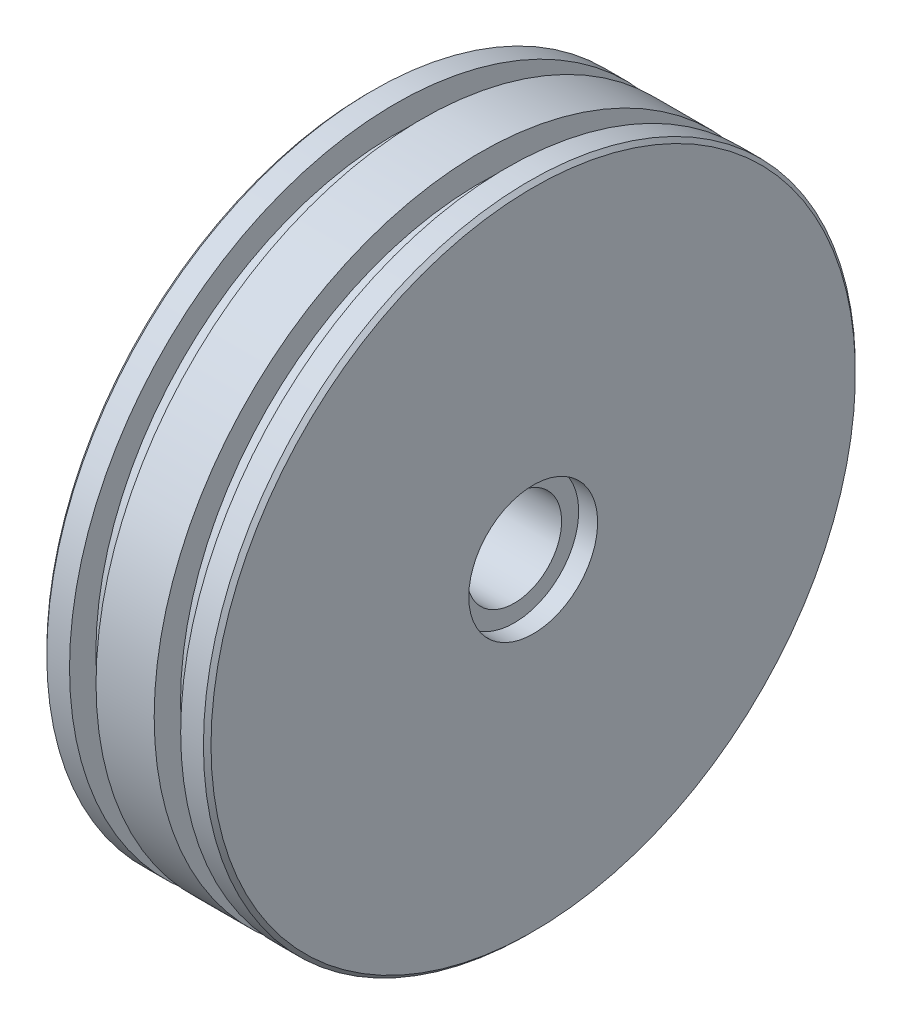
ISO-10303-21;
HEADER;
FILE_DESCRIPTION(('STEP AP214'),'2;1');
FILE_NAME('part.step','',(''),(''),'','','');
FILE_SCHEMA(('AUTOMOTIVE_DESIGN { 1 0 10303 214 1 1 1 1 }'));
ENDSEC;
DATA;
#1=APPLICATION_CONTEXT('core data for automotive mechanical design processes');
#2=APPLICATION_PROTOCOL_DEFINITION('international standard','automotive_design',2000,#1);
#3=PRODUCT_CONTEXT('',#1,'mechanical');
#4=PRODUCT('Part','Part','',(#3));
#5=PRODUCT_RELATED_PRODUCT_CATEGORY('part','',(#4));
#6=PRODUCT_DEFINITION_FORMATION('','',#4);
#7=PRODUCT_DEFINITION_CONTEXT('part definition',#1,'design');
#8=PRODUCT_DEFINITION('design','',#6,#7);
#9=PRODUCT_DEFINITION_SHAPE('','',#8);
#10=(LENGTH_UNIT() NAMED_UNIT(*) SI_UNIT(.MILLI.,.METRE.));
#11=(NAMED_UNIT(*) PLANE_ANGLE_UNIT() SI_UNIT($,.RADIAN.));
#12=(NAMED_UNIT(*) SI_UNIT($,.STERADIAN.) SOLID_ANGLE_UNIT());
#13=UNCERTAINTY_MEASURE_WITH_UNIT(LENGTH_MEASURE(1.E-05),#10,'distance_accuracy_value','');
#14=(GEOMETRIC_REPRESENTATION_CONTEXT(3) GLOBAL_UNCERTAINTY_ASSIGNED_CONTEXT((#13)) GLOBAL_UNIT_ASSIGNED_CONTEXT((#10,
#11,#12)) REPRESENTATION_CONTEXT('',''));
#15=CARTESIAN_POINT('',(0.,0.,0.));
#16=DIRECTION('',(0.,0.,1.));
#17=DIRECTION('',(1.,0.,0.));
#18=AXIS2_PLACEMENT_3D('',#15,#16,#17);
#19=CARTESIAN_POINT('',(-33.01,0.,0.));
#20=DIRECTION('',(-1.,0.,0.));
#21=DIRECTION('',(0.,0.,1.));
#22=AXIS2_PLACEMENT_3D('',#19,#20,#21);
#23=TOROIDAL_SURFACE('',#22,35.7504693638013,2.);
#24=CARTESIAN_POINT('',(-33.7592131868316,0.,0.));
#25=DIRECTION('',(-1.,0.,0.));
#26=DIRECTION('',(0.,0.,1.));
#27=AXIS2_PLACEMENT_3D('',#24,#25,#26);
#28=CIRCLE('',#27,33.8961016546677);
#29=CARTESIAN_POINT('',(-33.7592131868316,0.,33.8961016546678));
#30=VERTEX_POINT('',#29);
#31=EDGE_CURVE('E137',#30,#30,#28,.T.);
#32=ORIENTED_EDGE('',*,*,#31,.F.);
#33=EDGE_LOOP('',(#32));
#34=FACE_BOUND('',#33,.T.);
#35=CARTESIAN_POINT('',(-35.0100000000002,0.,0.));
#36=DIRECTION('',(-1.,0.,0.));
#37=DIRECTION('',(0.,0.,1.));
#38=AXIS2_PLACEMENT_3D('',#35,#36,#37);
#39=CIRCLE('',#38,35.7504693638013);
#40=CARTESIAN_POINT('',(-35.0100000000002,0.,35.7504693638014));
#41=VERTEX_POINT('',#40);
#42=EDGE_CURVE('E12',#41,#41,#39,.T.);
#43=ORIENTED_EDGE('',*,*,#42,.T.);
#44=EDGE_LOOP('',(#43));
#45=FACE_BOUND('',#44,.T.);
#46=ADVANCED_FACE('F40',(#34,#45),#23,.T.);
#47=CARTESIAN_POINT('',(-35.0100000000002,36.9999999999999,0.));
#48=DIRECTION('',(1.,0.,0.));
#49=DIRECTION('',(0.,0.,-1.));
#50=AXIS2_PLACEMENT_3D('',#47,#48,#49);
#51=PLANE('',#50);
#52=ORIENTED_EDGE('',*,*,#42,.F.);
#53=EDGE_LOOP('',(#52));
#54=FACE_BOUND('',#53,.T.);
#55=CARTESIAN_POINT('',(-35.0100000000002,0.,0.));
#56=DIRECTION('',(-1.,0.,0.));
#57=DIRECTION('',(0.,0.,1.));
#58=AXIS2_PLACEMENT_3D('',#55,#56,#57);
#59=CIRCLE('',#58,37.);
#60=CARTESIAN_POINT('',(-35.0100000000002,0.,37.0000000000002));
#61=VERTEX_POINT('',#60);
#62=EDGE_CURVE('E46',#61,#61,#59,.T.);
#63=ORIENTED_EDGE('',*,*,#62,.T.);
#64=EDGE_LOOP('',(#63));
#65=FACE_BOUND('',#64,.T.);
#66=ADVANCED_FACE('F144',(#54,#65),#51,.F.);
#67=CARTESIAN_POINT('',(-32.0100000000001,0.,0.));
#68=DIRECTION('',(-1.,0.,0.));
#69=DIRECTION('',(0.,0.,1.));
#70=AXIS2_PLACEMENT_3D('',#67,#68,#69);
#71=TOROIDAL_SURFACE('',#70,37.,3.00000000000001);
#72=ORIENTED_EDGE('',*,*,#62,.F.);
#73=EDGE_LOOP('',(#72));
#74=FACE_BOUND('',#73,.T.);
#75=CARTESIAN_POINT('',(-32.0100000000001,0.,0.));
#76=DIRECTION('',(-1.,0.,0.));
#77=DIRECTION('',(0.,0.,1.));
#78=AXIS2_PLACEMENT_3D('',#75,#76,#77);
#79=CIRCLE('',#78,40.);
#80=CARTESIAN_POINT('',(-32.0100000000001,0.,40.0000000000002));
#81=VERTEX_POINT('',#80);
#82=EDGE_CURVE('E50',#81,#81,#79,.T.);
#83=ORIENTED_EDGE('',*,*,#82,.T.);
#84=EDGE_LOOP('',(#83));
#85=FACE_BOUND('',#84,.T.);
#86=ADVANCED_FACE('F148',(#74,#85),#71,.T.);
#87=CARTESIAN_POINT('',(-110.,0.,0.));
#88=DIRECTION('',(-1.,0.,0.));
#89=DIRECTION('',(0.,0.,1.));
#90=AXIS2_PLACEMENT_3D('',#87,#88,#89);
#91=CYLINDRICAL_SURFACE('',#90,40.);
#92=ORIENTED_EDGE('',*,*,#82,.F.);
#93=EDGE_LOOP('',(#92));
#94=FACE_BOUND('',#93,.T.);
#95=CARTESIAN_POINT('',(-29.01,0.,0.));
#96=DIRECTION('',(-1.,0.,0.));
#97=DIRECTION('',(0.,0.,1.));
#98=AXIS2_PLACEMENT_3D('',#95,#96,#97);
#99=CIRCLE('',#98,40.);
#100=CARTESIAN_POINT('',(-29.01,0.,40.0000000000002));
#101=VERTEX_POINT('',#100);
#102=EDGE_CURVE('E54',#101,#101,#99,.T.);
#103=ORIENTED_EDGE('',*,*,#102,.T.);
#104=EDGE_LOOP('',(#103));
#105=FACE_BOUND('',#104,.T.);
#106=ADVANCED_FACE('F153',(#94,#105),#91,.T.);
#107=CARTESIAN_POINT('',(-29.01,0.,0.));
#108=DIRECTION('',(-1.,0.,0.));
#109=DIRECTION('',(0.,0.,1.));
#110=AXIS2_PLACEMENT_3D('',#107,#108,#109);
#111=TOROIDAL_SURFACE('',#110,43.,3.);
#112=ORIENTED_EDGE('',*,*,#102,.F.);
#113=EDGE_LOOP('',(#112));
#114=FACE_BOUND('',#113,.T.);
#115=CARTESIAN_POINT('',(-26.0099999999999,0.,0.));
#116=DIRECTION('',(-1.,0.,0.));
#117=DIRECTION('',(0.,0.,1.));
#118=AXIS2_PLACEMENT_3D('',#115,#116,#117);
#119=CIRCLE('',#118,43.);
#120=CARTESIAN_POINT('',(-26.0099999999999,0.,43.0000000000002));
#121=VERTEX_POINT('',#120);
#122=EDGE_CURVE('E59',#121,#121,#119,.T.);
#123=ORIENTED_EDGE('',*,*,#122,.T.);
#124=EDGE_LOOP('',(#123));
#125=FACE_BOUND('',#124,.T.);
#126=ADVANCED_FACE('F159',(#114,#125),#111,.F.);
#127=CARTESIAN_POINT('',(-26.0099999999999,70.0000000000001,0.));
#128=DIRECTION('',(1.,0.,0.));
#129=DIRECTION('',(0.,0.,-1.));
#130=AXIS2_PLACEMENT_3D('',#127,#128,#129);
#131=PLANE('',#130);
#132=ORIENTED_EDGE('',*,*,#122,.F.);
#133=EDGE_LOOP('',(#132));
#134=FACE_BOUND('',#133,.T.);
#135=CARTESIAN_POINT('',(-26.0099999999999,0.,0.));
#136=DIRECTION('',(-1.,0.,0.));
#137=DIRECTION('',(0.,0.,1.));
#138=AXIS2_PLACEMENT_3D('',#135,#136,#137);
#139=CIRCLE('',#138,70.);
#140=CARTESIAN_POINT('',(-26.0099999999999,0.,70.0000000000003));
#141=VERTEX_POINT('',#140);
#142=EDGE_CURVE('E62',#141,#141,#139,.T.);
#143=ORIENTED_EDGE('',*,*,#142,.T.);
#144=EDGE_LOOP('',(#143));
#145=FACE_BOUND('',#144,.T.);
#146=ADVANCED_FACE('F163',(#134,#145),#131,.F.);
#147=CARTESIAN_POINT('',(-29.01,0.,0.));
#148=DIRECTION('',(-1.,0.,0.));
#149=DIRECTION('',(0.,0.,1.));
#150=AXIS2_PLACEMENT_3D('',#147,#148,#149);
#151=TOROIDAL_SURFACE('',#150,70.,3.);
#152=ORIENTED_EDGE('',*,*,#142,.F.);
#153=EDGE_LOOP('',(#152));
#154=FACE_BOUND('',#153,.T.);
#155=CARTESIAN_POINT('',(-29.01,0.,0.));
#156=DIRECTION('',(-1.,0.,0.));
#157=DIRECTION('',(0.,0.,1.));
#158=AXIS2_PLACEMENT_3D('',#155,#156,#157);
#159=CIRCLE('',#158,73.);
#160=CARTESIAN_POINT('',(-29.01,0.,73.0000000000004));
#161=VERTEX_POINT('',#160);
#162=EDGE_CURVE('E65',#161,#161,#159,.T.);
#163=ORIENTED_EDGE('',*,*,#162,.T.);
#164=EDGE_LOOP('',(#163));
#165=FACE_BOUND('',#164,.T.);
#166=ADVANCED_FACE('F167',(#154,#165),#151,.F.);
#167=CARTESIAN_POINT('',(-110.,0.,0.));
#168=DIRECTION('',(-1.,0.,0.));
#169=DIRECTION('',(0.,0.,1.));
#170=AXIS2_PLACEMENT_3D('',#167,#168,#169);
#171=CYLINDRICAL_SURFACE('',#170,73.);
#172=ORIENTED_EDGE('',*,*,#162,.F.);
#173=EDGE_LOOP('',(#172));
#174=FACE_BOUND('',#173,.T.);
#175=CARTESIAN_POINT('',(-60.3314699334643,0.,0.));
#176=DIRECTION('',(-1.,0.,0.));
#177=DIRECTION('',(0.,0.,1.));
#178=AXIS2_PLACEMENT_3D('',#175,#176,#177);
#179=CIRCLE('',#178,73.);
#180=CARTESIAN_POINT('',(-60.3314699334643,0.,73.0000000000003));
#181=VERTEX_POINT('',#180);
#182=EDGE_CURVE('E68',#181,#181,#179,.T.);
#183=ORIENTED_EDGE('',*,*,#182,.T.);
#184=EDGE_LOOP('',(#183));
#185=FACE_BOUND('',#184,.T.);
#186=ADVANCED_FACE('F171',(#174,#185),#171,.F.);
#187=CARTESIAN_POINT('',(-60.3314699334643,0.,0.));
#188=DIRECTION('',(-1.,0.,0.));
#189=DIRECTION('',(0.,0.,1.));
#190=AXIS2_PLACEMENT_3D('',#187,#188,#189);
#191=TOROIDAL_SURFACE('',#190,76.,3.00000000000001);
#192=ORIENTED_EDGE('',*,*,#182,.F.);
#193=EDGE_LOOP('',(#192));
#194=FACE_BOUND('',#193,.T.);
#195=CARTESIAN_POINT('',(-63.3314699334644,0.,0.));
#196=DIRECTION('',(-1.,0.,0.));
#197=DIRECTION('',(0.,0.,1.));
#198=AXIS2_PLACEMENT_3D('',#195,#196,#197);
#199=CIRCLE('',#198,76.);
#200=CARTESIAN_POINT('',(-63.3314699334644,0.,76.0000000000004));
#201=VERTEX_POINT('',#200);
#202=EDGE_CURVE('E71',#201,#201,#199,.T.);
#203=ORIENTED_EDGE('',*,*,#202,.T.);
#204=EDGE_LOOP('',(#203));
#205=FACE_BOUND('',#204,.T.);
#206=ADVANCED_FACE('F175',(#194,#205),#191,.T.);
#207=CARTESIAN_POINT('',(-63.3314699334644,85.,0.));
#208=DIRECTION('',(1.,0.,0.));
#209=DIRECTION('',(0.,0.,-1.));
#210=AXIS2_PLACEMENT_3D('',#207,#208,#209);
#211=PLANE('',#210);
#212=ORIENTED_EDGE('',*,*,#202,.F.);
#213=EDGE_LOOP('',(#212));
#214=FACE_BOUND('',#213,.T.);
#215=CARTESIAN_POINT('',(-63.3314699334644,0.,0.));
#216=DIRECTION('',(-1.,0.,0.));
#217=DIRECTION('',(0.,0.,1.));
#218=AXIS2_PLACEMENT_3D('',#215,#216,#217);
#219=CIRCLE('',#218,85.);
#220=CARTESIAN_POINT('',(-63.3314699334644,0.,85.0000000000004));
#221=VERTEX_POINT('',#220);
#222=EDGE_CURVE('E74',#221,#221,#219,.T.);
#223=ORIENTED_EDGE('',*,*,#222,.T.);
#224=EDGE_LOOP('',(#223));
#225=FACE_BOUND('',#224,.T.);
#226=ADVANCED_FACE('F179',(#214,#225),#211,.F.);
#227=CARTESIAN_POINT('',(-62.3314699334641,0.,0.));
#228=DIRECTION('',(1.,0.,0.));
#229=DIRECTION('',(0.,0.,-1.));
#230=AXIS2_PLACEMENT_3D('',#227,#228,#229);
#231=CONICAL_SURFACE('',#230,86.,0.785398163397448);
#232=ORIENTED_EDGE('',*,*,#222,.F.);
#233=EDGE_LOOP('',(#232));
#234=FACE_BOUND('',#233,.T.);
#235=CARTESIAN_POINT('',(-62.3314699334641,0.,0.));
#236=DIRECTION('',(-1.,0.,0.));
#237=DIRECTION('',(0.,0.,1.));
#238=AXIS2_PLACEMENT_3D('',#235,#236,#237);
#239=CIRCLE('',#238,86.);
#240=CARTESIAN_POINT('',(-62.3314699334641,0.,86.0000000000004));
#241=VERTEX_POINT('',#240);
#242=EDGE_CURVE('E77',#241,#241,#239,.T.);
#243=ORIENTED_EDGE('',*,*,#242,.T.);
#244=EDGE_LOOP('',(#243));
#245=FACE_BOUND('',#244,.T.);
#246=ADVANCED_FACE('F183',(#234,#245),#231,.T.);
#247=CARTESIAN_POINT('',(-110.,0.,0.));
#248=DIRECTION('',(-1.,0.,0.));
#249=DIRECTION('',(0.,0.,1.));
#250=AXIS2_PLACEMENT_3D('',#247,#248,#249);
#251=CYLINDRICAL_SURFACE('',#250,86.);
#252=ORIENTED_EDGE('',*,*,#242,.F.);
#253=EDGE_LOOP('',(#252));
#254=FACE_BOUND('',#253,.T.);
#255=CARTESIAN_POINT('',(-56.3314699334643,0.,0.));
#256=DIRECTION('',(-1.,0.,0.));
#257=DIRECTION('',(0.,0.,1.));
#258=AXIS2_PLACEMENT_3D('',#255,#256,#257);
#259=CIRCLE('',#258,86.);
#260=CARTESIAN_POINT('',(-56.3314699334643,0.,86.0000000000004));
#261=VERTEX_POINT('',#260);
#262=EDGE_CURVE('E80',#261,#261,#259,.T.);
#263=ORIENTED_EDGE('',*,*,#262,.T.);
#264=EDGE_LOOP('',(#263));
#265=FACE_BOUND('',#264,.T.);
#266=ADVANCED_FACE('F187',(#254,#265),#251,.T.);
#267=CARTESIAN_POINT('',(-56.3314699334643,86.0000000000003,0.));
#268=DIRECTION('',(-1.,0.,0.));
#269=DIRECTION('',(0.,0.,1.));
#270=AXIS2_PLACEMENT_3D('',#267,#268,#269);
#271=PLANE('',#270);
#272=ORIENTED_EDGE('',*,*,#262,.F.);
#273=EDGE_LOOP('',(#272));
#274=FACE_BOUND('',#273,.T.);
#275=CARTESIAN_POINT('',(-56.3314699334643,0.,0.));
#276=DIRECTION('',(-1.,0.,0.));
#277=DIRECTION('',(0.,0.,1.));
#278=AXIS2_PLACEMENT_3D('',#275,#276,#277);
#279=CIRCLE('',#278,79.05);
#280=CARTESIAN_POINT('',(-56.3314699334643,0.,79.0500000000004));
#281=VERTEX_POINT('',#280);
#282=EDGE_CURVE('E83',#281,#281,#279,.T.);
#283=ORIENTED_EDGE('',*,*,#282,.T.);
#284=EDGE_LOOP('',(#283));
#285=FACE_BOUND('',#284,.T.);
#286=ADVANCED_FACE('F191',(#274,#285),#271,.F.);
#287=CARTESIAN_POINT('',(-110.,0.,0.));
#288=DIRECTION('',(-1.,0.,0.));
#289=DIRECTION('',(0.,0.,1.));
#290=AXIS2_PLACEMENT_3D('',#287,#288,#289);
#291=CYLINDRICAL_SURFACE('',#290,79.05);
#292=ORIENTED_EDGE('',*,*,#282,.F.);
#293=EDGE_LOOP('',(#292));
#294=FACE_BOUND('',#293,.T.);
#295=CARTESIAN_POINT('',(-49.3414699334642,0.,0.));
#296=DIRECTION('',(-1.,0.,0.));
#297=DIRECTION('',(0.,0.,1.));
#298=AXIS2_PLACEMENT_3D('',#295,#296,#297);
#299=CIRCLE('',#298,79.05);
#300=CARTESIAN_POINT('',(-49.3414699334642,0.,79.0500000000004));
#301=VERTEX_POINT('',#300);
#302=EDGE_CURVE('E86',#301,#301,#299,.T.);
#303=ORIENTED_EDGE('',*,*,#302,.T.);
#304=EDGE_LOOP('',(#303));
#305=FACE_BOUND('',#304,.T.);
#306=ADVANCED_FACE('F195',(#294,#305),#291,.T.);
#307=CARTESIAN_POINT('',(-49.3414699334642,86.0000000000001,0.));
#308=DIRECTION('',(1.,0.,0.));
#309=DIRECTION('',(0.,0.,-1.));
#310=AXIS2_PLACEMENT_3D('',#307,#308,#309);
#311=PLANE('',#310);
#312=ORIENTED_EDGE('',*,*,#302,.F.);
#313=EDGE_LOOP('',(#312));
#314=FACE_BOUND('',#313,.T.);
#315=CARTESIAN_POINT('',(-49.3414699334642,0.,0.));
#316=DIRECTION('',(-1.,0.,0.));
#317=DIRECTION('',(0.,0.,1.));
#318=AXIS2_PLACEMENT_3D('',#315,#316,#317);
#319=CIRCLE('',#318,86.);
#320=CARTESIAN_POINT('',(-49.3414699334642,0.,86.0000000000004));
#321=VERTEX_POINT('',#320);
#322=EDGE_CURVE('E89',#321,#321,#319,.T.);
#323=ORIENTED_EDGE('',*,*,#322,.T.);
#324=EDGE_LOOP('',(#323));
#325=FACE_BOUND('',#324,.T.);
#326=ADVANCED_FACE('F199',(#314,#325),#311,.F.);
#327=CARTESIAN_POINT('',(-110.,0.,0.));
#328=DIRECTION('',(-1.,0.,0.));
#329=DIRECTION('',(0.,0.,1.));
#330=AXIS2_PLACEMENT_3D('',#327,#328,#329);
#331=CYLINDRICAL_SURFACE('',#330,86.);
#332=ORIENTED_EDGE('',*,*,#322,.F.);
#333=EDGE_LOOP('',(#332));
#334=FACE_BOUND('',#333,.T.);
#335=CARTESIAN_POINT('',(-34.0000000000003,0.,0.));
#336=DIRECTION('',(-1.,0.,0.));
#337=DIRECTION('',(0.,0.,1.));
#338=AXIS2_PLACEMENT_3D('',#335,#336,#337);
#339=CIRCLE('',#338,86.);
#340=CARTESIAN_POINT('',(-34.0000000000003,0.,86.0000000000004));
#341=VERTEX_POINT('',#340);
#342=EDGE_CURVE('E92',#341,#341,#339,.T.);
#343=ORIENTED_EDGE('',*,*,#342,.T.);
#344=EDGE_LOOP('',(#343));
#345=FACE_BOUND('',#344,.T.);
#346=ADVANCED_FACE('F203',(#334,#345),#331,.T.);
#347=CARTESIAN_POINT('',(-34.0000000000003,86.0000000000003,0.));
#348=DIRECTION('',(-1.,0.,0.));
#349=DIRECTION('',(0.,0.,1.));
#350=AXIS2_PLACEMENT_3D('',#347,#348,#349);
#351=PLANE('',#350);
#352=ORIENTED_EDGE('',*,*,#342,.F.);
#353=EDGE_LOOP('',(#352));
#354=FACE_BOUND('',#353,.T.);
#355=CARTESIAN_POINT('',(-34.0000000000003,0.,0.));
#356=DIRECTION('',(-1.,0.,0.));
#357=DIRECTION('',(0.,0.,1.));
#358=AXIS2_PLACEMENT_3D('',#355,#356,#357);
#359=CIRCLE('',#358,79.05);
#360=CARTESIAN_POINT('',(-34.0000000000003,0.,79.0500000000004));
#361=VERTEX_POINT('',#360);
#362=EDGE_CURVE('E95',#361,#361,#359,.T.);
#363=ORIENTED_EDGE('',*,*,#362,.T.);
#364=EDGE_LOOP('',(#363));
#365=FACE_BOUND('',#364,.T.);
#366=ADVANCED_FACE('F207',(#354,#365),#351,.F.);
#367=CARTESIAN_POINT('',(-110.,0.,0.));
#368=DIRECTION('',(-1.,0.,0.));
#369=DIRECTION('',(0.,0.,1.));
#370=AXIS2_PLACEMENT_3D('',#367,#368,#369);
#371=CYLINDRICAL_SURFACE('',#370,79.05);
#372=ORIENTED_EDGE('',*,*,#362,.F.);
#373=EDGE_LOOP('',(#372));
#374=FACE_BOUND('',#373,.T.);
#375=CARTESIAN_POINT('',(-27.0100000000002,0.,0.));
#376=DIRECTION('',(-1.,0.,0.));
#377=DIRECTION('',(0.,0.,1.));
#378=AXIS2_PLACEMENT_3D('',#375,#376,#377);
#379=CIRCLE('',#378,79.05);
#380=CARTESIAN_POINT('',(-27.0100000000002,0.,79.0500000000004));
#381=VERTEX_POINT('',#380);
#382=EDGE_CURVE('E98',#381,#381,#379,.T.);
#383=ORIENTED_EDGE('',*,*,#382,.T.);
#384=EDGE_LOOP('',(#383));
#385=FACE_BOUND('',#384,.T.);
#386=ADVANCED_FACE('F211',(#374,#385),#371,.T.);
#387=CARTESIAN_POINT('',(-27.0100000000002,86.0000000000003,0.));
#388=DIRECTION('',(1.,0.,0.));
#389=DIRECTION('',(0.,0.,-1.));
#390=AXIS2_PLACEMENT_3D('',#387,#388,#389);
#391=PLANE('',#390);
#392=ORIENTED_EDGE('',*,*,#382,.F.);
#393=EDGE_LOOP('',(#392));
#394=FACE_BOUND('',#393,.T.);
#395=CARTESIAN_POINT('',(-27.0100000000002,0.,0.));
#396=DIRECTION('',(-1.,0.,0.));
#397=DIRECTION('',(0.,0.,1.));
#398=AXIS2_PLACEMENT_3D('',#395,#396,#397);
#399=CIRCLE('',#398,86.);
#400=CARTESIAN_POINT('',(-27.0100000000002,0.,86.0000000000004));
#401=VERTEX_POINT('',#400);
#402=EDGE_CURVE('E101',#401,#401,#399,.T.);
#403=ORIENTED_EDGE('',*,*,#402,.T.);
#404=EDGE_LOOP('',(#403));
#405=FACE_BOUND('',#404,.T.);
#406=ADVANCED_FACE('F215',(#394,#405),#391,.F.);
#407=CARTESIAN_POINT('',(-110.,0.,0.));
#408=DIRECTION('',(-1.,0.,0.));
#409=DIRECTION('',(0.,0.,1.));
#410=AXIS2_PLACEMENT_3D('',#407,#408,#409);
#411=CYLINDRICAL_SURFACE('',#410,86.);
#412=ORIENTED_EDGE('',*,*,#402,.F.);
#413=EDGE_LOOP('',(#412));
#414=FACE_BOUND('',#413,.T.);
#415=CARTESIAN_POINT('',(-21.01,0.,0.));
#416=DIRECTION('',(-1.,0.,0.));
#417=DIRECTION('',(0.,0.,1.));
#418=AXIS2_PLACEMENT_3D('',#415,#416,#417);
#419=CIRCLE('',#418,86.);
#420=CARTESIAN_POINT('',(-21.01,0.,86.0000000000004));
#421=VERTEX_POINT('',#420);
#422=EDGE_CURVE('E104',#421,#421,#419,.T.);
#423=ORIENTED_EDGE('',*,*,#422,.T.);
#424=EDGE_LOOP('',(#423));
#425=FACE_BOUND('',#424,.T.);
#426=ADVANCED_FACE('F219',(#414,#425),#411,.T.);
#427=CARTESIAN_POINT('',(-20.0100000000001,0.,0.));
#428=DIRECTION('',(-1.,0.,0.));
#429=DIRECTION('',(0.,0.,1.));
#430=AXIS2_PLACEMENT_3D('',#427,#428,#429);
#431=CONICAL_SURFACE('',#430,85.,0.785398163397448);
#432=ORIENTED_EDGE('',*,*,#422,.F.);
#433=EDGE_LOOP('',(#432));
#434=FACE_BOUND('',#433,.T.);
#435=CARTESIAN_POINT('',(-20.0100000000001,0.,0.));
#436=DIRECTION('',(-1.,0.,0.));
#437=DIRECTION('',(0.,0.,1.));
#438=AXIS2_PLACEMENT_3D('',#435,#436,#437);
#439=CIRCLE('',#438,85.);
#440=CARTESIAN_POINT('',(-20.0100000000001,0.,85.0000000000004));
#441=VERTEX_POINT('',#440);
#442=EDGE_CURVE('E107',#441,#441,#439,.T.);
#443=ORIENTED_EDGE('',*,*,#442,.T.);
#444=EDGE_LOOP('',(#443));
#445=FACE_BOUND('',#444,.T.);
#446=ADVANCED_FACE('F223',(#434,#445),#431,.T.);
#447=CARTESIAN_POINT('',(-20.0100000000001,85.0000000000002,0.));
#448=DIRECTION('',(-1.,0.,0.));
#449=DIRECTION('',(0.,0.,1.));
#450=AXIS2_PLACEMENT_3D('',#447,#448,#449);
#451=PLANE('',#450);
#452=ORIENTED_EDGE('',*,*,#442,.F.);
#453=EDGE_LOOP('',(#452));
#454=FACE_BOUND('',#453,.T.);
#455=CARTESIAN_POINT('',(-20.0100000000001,0.,0.));
#456=DIRECTION('',(-1.,0.,0.));
#457=DIRECTION('',(0.,0.,1.));
#458=AXIS2_PLACEMENT_3D('',#455,#456,#457);
#459=CIRCLE('',#458,17.);
#460=CARTESIAN_POINT('',(-20.0100000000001,0.,17.0000000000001));
#461=VERTEX_POINT('',#460);
#462=EDGE_CURVE('E110',#461,#461,#459,.T.);
#463=ORIENTED_EDGE('',*,*,#462,.T.);
#464=EDGE_LOOP('',(#463));
#465=FACE_BOUND('',#464,.T.);
#466=ADVANCED_FACE('F227',(#454,#465),#451,.F.);
#467=CARTESIAN_POINT('',(-110.,0.,0.));
#468=DIRECTION('',(-1.,0.,0.));
#469=DIRECTION('',(0.,0.,1.));
#470=AXIS2_PLACEMENT_3D('',#467,#468,#469);
#471=CYLINDRICAL_SURFACE('',#470,17.);
#472=ORIENTED_EDGE('',*,*,#462,.F.);
#473=EDGE_LOOP('',(#472));
#474=FACE_BOUND('',#473,.T.);
#475=CARTESIAN_POINT('',(-25.01,0.,0.));
#476=DIRECTION('',(-1.,0.,0.));
#477=DIRECTION('',(0.,0.,1.));
#478=AXIS2_PLACEMENT_3D('',#475,#476,#477);
#479=CIRCLE('',#478,17.);
#480=CARTESIAN_POINT('',(-25.01,0.,17.0000000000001));
#481=VERTEX_POINT('',#480);
#482=EDGE_CURVE('E113',#481,#481,#479,.T.);
#483=ORIENTED_EDGE('',*,*,#482,.T.);
#484=EDGE_LOOP('',(#483));
#485=FACE_BOUND('',#484,.T.);
#486=ADVANCED_FACE('F231',(#474,#485),#471,.F.);
#487=CARTESIAN_POINT('',(-25.01,12.5,0.));
#488=DIRECTION('',(-1.,0.,0.));
#489=DIRECTION('',(0.,0.,1.));
#490=AXIS2_PLACEMENT_3D('',#487,#488,#489);
#491=PLANE('',#490);
#492=ORIENTED_EDGE('',*,*,#482,.F.);
#493=EDGE_LOOP('',(#492));
#494=FACE_BOUND('',#493,.T.);
#495=CARTESIAN_POINT('',(-25.01,0.,0.));
#496=DIRECTION('',(-1.,0.,0.));
#497=DIRECTION('',(0.,0.,1.));
#498=AXIS2_PLACEMENT_3D('',#495,#496,#497);
#499=CIRCLE('',#498,12.5);
#500=CARTESIAN_POINT('',(-25.01,0.,12.5000000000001));
#501=VERTEX_POINT('',#500);
#502=EDGE_CURVE('E116',#501,#501,#499,.T.);
#503=ORIENTED_EDGE('',*,*,#502,.T.);
#504=EDGE_LOOP('',(#503));
#505=FACE_BOUND('',#504,.T.);
#506=ADVANCED_FACE('F235',(#494,#505),#491,.F.);
#507=CARTESIAN_POINT('',(-110.,0.,0.));
#508=DIRECTION('',(-1.,0.,0.));
#509=DIRECTION('',(0.,0.,1.));
#510=AXIS2_PLACEMENT_3D('',#507,#508,#509);
#511=CYLINDRICAL_SURFACE('',#510,12.5);
#512=ORIENTED_EDGE('',*,*,#502,.F.);
#513=EDGE_LOOP('',(#512));
#514=FACE_BOUND('',#513,.T.);
#515=CARTESIAN_POINT('',(-46.0099999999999,0.,0.));
#516=DIRECTION('',(-1.,0.,0.));
#517=DIRECTION('',(0.,0.,1.));
#518=AXIS2_PLACEMENT_3D('',#515,#516,#517);
#519=CIRCLE('',#518,12.5);
#520=CARTESIAN_POINT('',(-46.0099999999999,0.,12.5000000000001));
#521=VERTEX_POINT('',#520);
#522=EDGE_CURVE('E119',#521,#521,#519,.T.);
#523=ORIENTED_EDGE('',*,*,#522,.T.);
#524=EDGE_LOOP('',(#523));
#525=FACE_BOUND('',#524,.T.);
#526=ADVANCED_FACE('F239',(#514,#525),#511,.F.);
#527=CARTESIAN_POINT('',(-46.0099999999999,12.5,0.));
#528=DIRECTION('',(1.,0.,0.));
#529=DIRECTION('',(0.,0.,-1.));
#530=AXIS2_PLACEMENT_3D('',#527,#528,#529);
#531=PLANE('',#530);
#532=ORIENTED_EDGE('',*,*,#522,.F.);
#533=EDGE_LOOP('',(#532));
#534=FACE_BOUND('',#533,.T.);
#535=CARTESIAN_POINT('',(-46.0099999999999,0.,0.));
#536=DIRECTION('',(-1.,0.,0.));
#537=DIRECTION('',(0.,0.,1.));
#538=AXIS2_PLACEMENT_3D('',#535,#536,#537);
#539=CIRCLE('',#538,22.);
#540=CARTESIAN_POINT('',(-46.0099999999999,0.,22.0000000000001));
#541=VERTEX_POINT('',#540);
#542=EDGE_CURVE('E122',#541,#541,#539,.T.);
#543=ORIENTED_EDGE('',*,*,#542,.T.);
#544=EDGE_LOOP('',(#543));
#545=FACE_BOUND('',#544,.T.);
#546=ADVANCED_FACE('F243',(#534,#545),#531,.F.);
#547=CARTESIAN_POINT('',(-110.,0.,0.));
#548=DIRECTION('',(-1.,0.,0.));
#549=DIRECTION('',(0.,0.,1.));
#550=AXIS2_PLACEMENT_3D('',#547,#548,#549);
#551=CYLINDRICAL_SURFACE('',#550,22.);
#552=ORIENTED_EDGE('',*,*,#542,.F.);
#553=EDGE_LOOP('',(#552));
#554=FACE_BOUND('',#553,.T.);
#555=CARTESIAN_POINT('',(-32.3590170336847,0.,0.));
#556=DIRECTION('',(-1.,0.,0.));
#557=DIRECTION('',(0.,0.,1.));
#558=AXIS2_PLACEMENT_3D('',#555,#556,#557);
#559=CIRCLE('',#558,22.);
#560=CARTESIAN_POINT('',(-32.3590170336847,0.,22.0000000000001));
#561=VERTEX_POINT('',#560);
#562=EDGE_CURVE('E125',#561,#561,#559,.T.);
#563=ORIENTED_EDGE('',*,*,#562,.T.);
#564=EDGE_LOOP('',(#563));
#565=FACE_BOUND('',#564,.T.);
#566=ADVANCED_FACE('F247',(#554,#565),#551,.T.);
#567=CARTESIAN_POINT('',(-32.3590170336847,0.,0.));
#568=DIRECTION('',(-1.,0.,0.));
#569=DIRECTION('',(0.,0.,1.));
#570=AXIS2_PLACEMENT_3D('',#567,#568,#569);
#571=TOROIDAL_SURFACE('',#570,24.,2.);
#572=ORIENTED_EDGE('',*,*,#562,.F.);
#573=EDGE_LOOP('',(#572));
#574=FACE_BOUND('',#573,.T.);
#575=CARTESIAN_POINT('',(-30.5046493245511,0.,0.));
#576=DIRECTION('',(-1.,0.,0.));
#577=DIRECTION('',(0.,0.,1.));
#578=AXIS2_PLACEMENT_3D('',#575,#576,#577);
#579=CIRCLE('',#578,23.2507868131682);
#580=CARTESIAN_POINT('',(-30.5046493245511,0.,23.2507868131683));
#581=VERTEX_POINT('',#580);
#582=EDGE_CURVE('E128',#581,#581,#579,.T.);
#583=ORIENTED_EDGE('',*,*,#582,.T.);
#584=EDGE_LOOP('',(#583));
#585=FACE_BOUND('',#584,.T.);
#586=ADVANCED_FACE('F251',(#574,#585),#571,.F.);
#587=CARTESIAN_POINT('',(-28.0131472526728,0.,0.));
#588=DIRECTION('',(1.,0.,0.));
#589=DIRECTION('',(0.,0.,-1.));
#590=AXIS2_PLACEMENT_3D('',#587,#588,#589);
#591=CONICAL_SURFACE('',#590,29.4174708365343,1.18682389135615);
#592=ORIENTED_EDGE('',*,*,#582,.F.);
#593=EDGE_LOOP('',(#592));
#594=FACE_BOUND('',#593,.T.);
#595=CARTESIAN_POINT('',(-28.0131472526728,0.,0.));
#596=DIRECTION('',(-1.,0.,0.));
#597=DIRECTION('',(0.,0.,1.));
#598=AXIS2_PLACEMENT_3D('',#595,#596,#597);
#599=CIRCLE('',#598,29.4174708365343);
#600=CARTESIAN_POINT('',(-28.0131472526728,0.,29.4174708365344));
#601=VERTEX_POINT('',#600);
#602=EDGE_CURVE('E131',#601,#601,#599,.T.);
#603=ORIENTED_EDGE('',*,*,#602,.T.);
#604=EDGE_LOOP('',(#603));
#605=FACE_BOUND('',#604,.T.);
#606=ADVANCED_FACE('F255',(#594,#605),#591,.T.);
#607=CARTESIAN_POINT('',(-29.8675149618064,0.,0.));
#608=DIRECTION('',(-1.,0.,0.));
#609=DIRECTION('',(0.,0.,1.));
#610=AXIS2_PLACEMENT_3D('',#607,#608,#609);
#611=TOROIDAL_SURFACE('',#610,30.1666840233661,2.);
#612=ORIENTED_EDGE('',*,*,#602,.F.);
#613=EDGE_LOOP('',(#612));
#614=FACE_BOUND('',#613,.T.);
#615=CARTESIAN_POINT('',(-29.1183017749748,0.,0.));
#616=DIRECTION('',(-1.,0.,0.));
#617=DIRECTION('',(0.,0.,1.));
#618=AXIS2_PLACEMENT_3D('',#615,#616,#617);
#619=CIRCLE('',#618,32.0210517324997);
#620=CARTESIAN_POINT('',(-29.1183017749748,0.,32.0210517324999));
#621=VERTEX_POINT('',#620);
#622=EDGE_CURVE('E134',#621,#621,#619,.T.);
#623=ORIENTED_EDGE('',*,*,#622,.T.);
#624=EDGE_LOOP('',(#623));
#625=FACE_BOUND('',#624,.T.);
#626=ADVANCED_FACE('F259',(#614,#625),#611,.F.);
#627=CARTESIAN_POINT('',(-33.7592131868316,0.,0.));
#628=DIRECTION('',(-1.,0.,0.));
#629=DIRECTION('',(0.,0.,1.));
#630=AXIS2_PLACEMENT_3D('',#627,#628,#629);
#631=CONICAL_SURFACE('',#630,33.8961016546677,0.383972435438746);
#632=ORIENTED_EDGE('',*,*,#622,.F.);
#633=EDGE_LOOP('',(#632));
#634=FACE_BOUND('',#633,.T.);
#635=ORIENTED_EDGE('',*,*,#31,.T.);
#636=EDGE_LOOP('',(#635));
#637=FACE_BOUND('',#636,.T.);
#638=ADVANCED_FACE('F141',(#634,#637),#631,.F.);
#639=CLOSED_SHELL('',(#46,#66,#86,#106,#126,#146,#166,#186,#206,#226,#246,#266,#286,#306,#326,
#346,#366,#386,#406,#426,#446,#466,#486,#506,#526,#546,#566,#586,#606,#626,#638));
#640=MANIFOLD_SOLID_BREP('B2',#639);
#641=ADVANCED_BREP_SHAPE_REPRESENTATION('',(#18,#640),#14);
#642=SHAPE_DEFINITION_REPRESENTATION(#9,#641);
ENDSEC;
END-ISO-10303-21;
